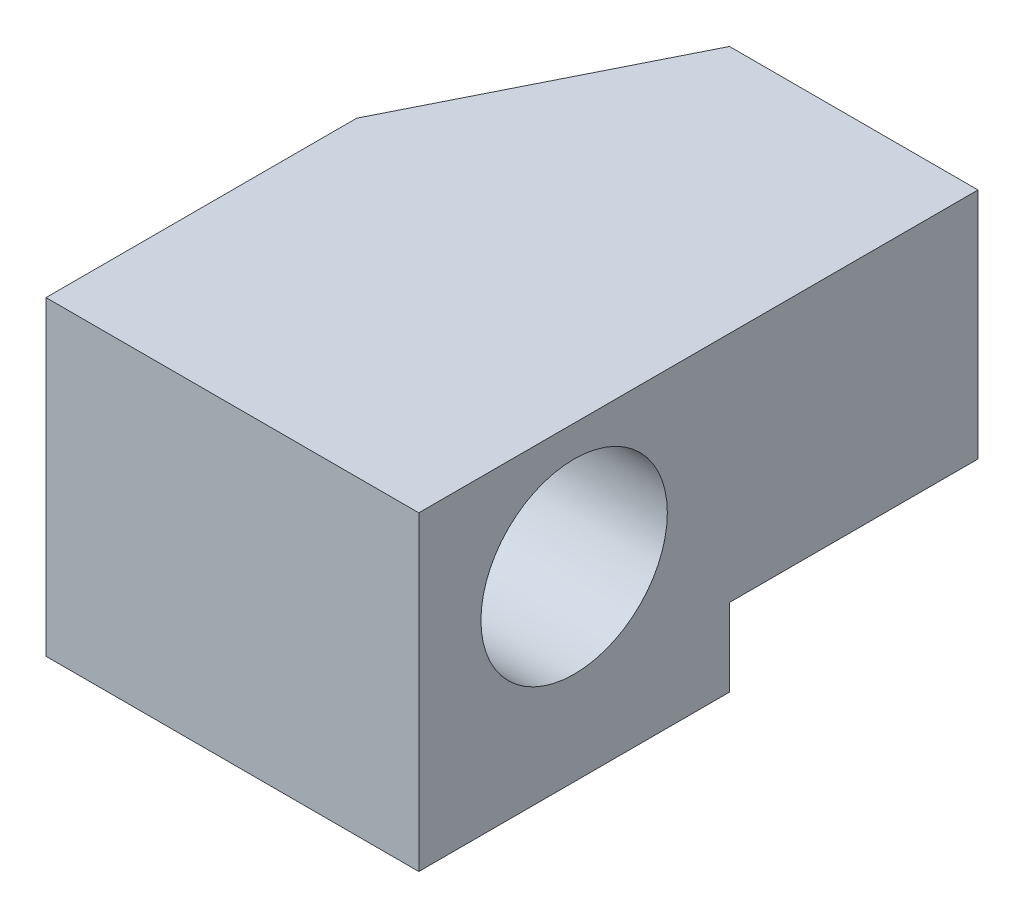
ISO-10303-21;
HEADER;
FILE_DESCRIPTION(('STEP AP214'),'2;1');
FILE_NAME('part.step','',(''),(''),'','','');
FILE_SCHEMA(('AUTOMOTIVE_DESIGN { 1 0 10303 214 1 1 1 1 }'));
ENDSEC;
DATA;
#1=APPLICATION_CONTEXT('core data for automotive mechanical design processes');
#2=APPLICATION_PROTOCOL_DEFINITION('international standard','automotive_design',2000,#1);
#3=PRODUCT_CONTEXT('',#1,'mechanical');
#4=PRODUCT('Part','Part','',(#3));
#5=PRODUCT_RELATED_PRODUCT_CATEGORY('part','',(#4));
#6=PRODUCT_DEFINITION_FORMATION('','',#4);
#7=PRODUCT_DEFINITION_CONTEXT('part definition',#1,'design');
#8=PRODUCT_DEFINITION('design','',#6,#7);
#9=PRODUCT_DEFINITION_SHAPE('','',#8);
#10=(LENGTH_UNIT() NAMED_UNIT(*) SI_UNIT(.MILLI.,.METRE.));
#11=(NAMED_UNIT(*) PLANE_ANGLE_UNIT() SI_UNIT($,.RADIAN.));
#12=(NAMED_UNIT(*) SI_UNIT($,.STERADIAN.) SOLID_ANGLE_UNIT());
#13=UNCERTAINTY_MEASURE_WITH_UNIT(LENGTH_MEASURE(1.E-05),#10,'distance_accuracy_value','');
#14=(GEOMETRIC_REPRESENTATION_CONTEXT(3) GLOBAL_UNCERTAINTY_ASSIGNED_CONTEXT((#13)) GLOBAL_UNIT_ASSIGNED_CONTEXT((#10,
#11,#12)) REPRESENTATION_CONTEXT('',''));
#15=CARTESIAN_POINT('',(0.,0.,0.));
#16=DIRECTION('',(0.,0.,1.));
#17=DIRECTION('',(1.,0.,0.));
#18=AXIS2_PLACEMENT_3D('',#15,#16,#17);
#19=CARTESIAN_POINT('',(-60.,50.,100.));
#20=DIRECTION('',(1.,0.,0.));
#21=DIRECTION('',(0.,1.,0.));
#22=AXIS2_PLACEMENT_3D('',#19,#20,#21);
#23=PLANE('',#22);
#24=CARTESIAN_POINT('',(-60.,9.99999999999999,50.));
#25=DIRECTION('',(-1.,0.,0.));
#26=DIRECTION('',(0.,-1.,0.));
#27=AXIS2_PLACEMENT_3D('',#24,#25,#26);
#28=CIRCLE('',#27,30.);
#29=CARTESIAN_POINT('',(-60.,-20.,50.));
#30=VERTEX_POINT('',#29);
#31=EDGE_CURVE('E193',#30,#30,#28,.T.);
#32=ORIENTED_EDGE('',*,*,#31,.F.);
#33=EDGE_LOOP('',(#32));
#34=FACE_BOUND('',#33,.T.);
#35=DIRECTION('',(0.,-1.,0.));
#36=VECTOR('',#35,1.);
#37=CARTESIAN_POINT('',(-60.,50.,0.));
#38=LINE('',#37,#36);
#39=CARTESIAN_POINT('',(-60.,50.,0.));
#40=VERTEX_POINT('',#39);
#41=CARTESIAN_POINT('',(-60.,-25.,0.));
#42=VERTEX_POINT('',#41);
#43=EDGE_CURVE('E130',#40,#42,#38,.T.);
#44=ORIENTED_EDGE('',*,*,#43,.T.);
#45=CARTESIAN_POINT('',(-60.,-50.,0.));
#46=VERTEX_POINT('',#45);
#47=EDGE_CURVE('E133',#42,#46,#38,.T.);
#48=ORIENTED_EDGE('',*,*,#47,.T.);
#49=DIRECTION('',(0.,0.,-1.));
#50=VECTOR('',#49,1.);
#51=CARTESIAN_POINT('',(-60.,-50.,100.));
#52=LINE('',#51,#50);
#53=CARTESIAN_POINT('',(-60.,-50.,100.));
#54=VERTEX_POINT('',#53);
#55=EDGE_CURVE('E11',#54,#46,#52,.T.);
#56=ORIENTED_EDGE('',*,*,#55,.F.);
#57=DIRECTION('',(0.,-1.,0.));
#58=VECTOR('',#57,1.);
#59=CARTESIAN_POINT('',(-60.,50.,100.));
#60=LINE('',#59,#58);
#61=CARTESIAN_POINT('',(-60.,50.,100.));
#62=VERTEX_POINT('',#61);
#63=EDGE_CURVE('E156',#62,#54,#60,.T.);
#64=ORIENTED_EDGE('',*,*,#63,.F.);
#65=DIRECTION('',(0.,0.,-1.));
#66=VECTOR('',#65,1.);
#67=CARTESIAN_POINT('',(-60.,50.,100.));
#68=LINE('',#67,#66);
#69=EDGE_CURVE('E140',#62,#40,#68,.T.);
#70=ORIENTED_EDGE('',*,*,#69,.T.);
#71=EDGE_LOOP('',(#44,#48,#56,#64,#70));
#72=FACE_BOUND('',#71,.T.);
#73=ADVANCED_FACE('F33',(#34,#72),#23,.F.);
#74=CARTESIAN_POINT('',(-60.,-50.,100.));
#75=DIRECTION('',(0.,1.,0.));
#76=DIRECTION('',(0.,0.,1.));
#77=AXIS2_PLACEMENT_3D('',#74,#75,#76);
#78=PLANE('',#77);
#79=DIRECTION('',(1.,0.,0.));
#80=VECTOR('',#79,1.);
#81=CARTESIAN_POINT('',(-60.,-50.,0.));
#82=LINE('',#81,#80);
#83=CARTESIAN_POINT('',(60.,-50.,0.));
#84=VERTEX_POINT('',#83);
#85=EDGE_CURVE('E73',#46,#84,#82,.T.);
#86=ORIENTED_EDGE('',*,*,#85,.T.);
#87=DIRECTION('',(0.,0.,-1.));
#88=VECTOR('',#87,1.);
#89=CARTESIAN_POINT('',(60.,-50.,100.));
#90=LINE('',#89,#88);
#91=CARTESIAN_POINT('',(60.,-50.,100.));
#92=VERTEX_POINT('',#91);
#93=EDGE_CURVE('E41',#92,#84,#90,.T.);
#94=ORIENTED_EDGE('',*,*,#93,.F.);
#95=DIRECTION('',(1.,0.,0.));
#96=VECTOR('',#95,1.);
#97=CARTESIAN_POINT('',(-60.,-50.,100.));
#98=LINE('',#97,#96);
#99=EDGE_CURVE('E78',#54,#92,#98,.T.);
#100=ORIENTED_EDGE('',*,*,#99,.F.);
#101=ORIENTED_EDGE('',*,*,#55,.T.);
#102=EDGE_LOOP('',(#86,#94,#100,#101));
#103=FACE_BOUND('',#102,.T.);
#104=ADVANCED_FACE('F163',(#103),#78,.F.);
#105=CARTESIAN_POINT('',(60.,50.,100.));
#106=DIRECTION('',(-1.,0.,0.));
#107=DIRECTION('',(0.,-1.,0.));
#108=AXIS2_PLACEMENT_3D('',#105,#106,#107);
#109=PLANE('',#108);
#110=CARTESIAN_POINT('',(60.,10.,50.));
#111=DIRECTION('',(-1.,0.,0.));
#112=DIRECTION('',(0.,-1.,0.));
#113=AXIS2_PLACEMENT_3D('',#110,#111,#112);
#114=CIRCLE('',#113,30.);
#115=CARTESIAN_POINT('',(60.,-20.,50.));
#116=VERTEX_POINT('',#115);
#117=EDGE_CURVE('E196',#116,#116,#114,.F.);
#118=ORIENTED_EDGE('',*,*,#117,.F.);
#119=EDGE_LOOP('',(#118));
#120=FACE_BOUND('',#119,.T.);
#121=DIRECTION('',(0.,1.,0.));
#122=VECTOR('',#121,1.);
#123=CARTESIAN_POINT('',(60.,50.,0.));
#124=LINE('',#123,#122);
#125=CARTESIAN_POINT('',(60.,-25.,0.));
#126=VERTEX_POINT('',#125);
#127=EDGE_CURVE('E116',#84,#126,#124,.T.);
#128=ORIENTED_EDGE('',*,*,#127,.T.);
#129=DIRECTION('',(0.,0.,-1.));
#130=VECTOR('',#129,1.);
#131=CARTESIAN_POINT('',(60.,-25.,-80.));
#132=LINE('',#131,#130);
#133=CARTESIAN_POINT('',(60.,-25.,-80.));
#134=VERTEX_POINT('',#133);
#135=EDGE_CURVE('E49',#126,#134,#132,.T.);
#136=ORIENTED_EDGE('',*,*,#135,.T.);
#137=DIRECTION('',(0.,1.,0.));
#138=VECTOR('',#137,1.);
#139=CARTESIAN_POINT('',(60.,-25.,-80.));
#140=LINE('',#139,#138);
#141=CARTESIAN_POINT('',(60.,50.,-80.));
#142=VERTEX_POINT('',#141);
#143=EDGE_CURVE('E99',#134,#142,#140,.T.);
#144=ORIENTED_EDGE('',*,*,#143,.T.);
#145=DIRECTION('',(0.,0.,-1.));
#146=VECTOR('',#145,1.);
#147=CARTESIAN_POINT('',(60.,50.,100.));
#148=LINE('',#147,#146);
#149=CARTESIAN_POINT('',(60.,50.,100.));
#150=VERTEX_POINT('',#149);
#151=EDGE_CURVE('E152',#150,#142,#148,.T.);
#152=ORIENTED_EDGE('',*,*,#151,.F.);
#153=DIRECTION('',(0.,1.,0.));
#154=VECTOR('',#153,1.);
#155=CARTESIAN_POINT('',(60.,50.,100.));
#156=LINE('',#155,#154);
#157=EDGE_CURVE('E155',#92,#150,#156,.T.);
#158=ORIENTED_EDGE('',*,*,#157,.F.);
#159=ORIENTED_EDGE('',*,*,#93,.T.);
#160=EDGE_LOOP('',(#128,#136,#144,#152,#158,#159));
#161=FACE_BOUND('',#160,.T.);
#162=ADVANCED_FACE('F114',(#120,#161),#109,.F.);
#163=CARTESIAN_POINT('',(-60.,50.,100.));
#164=DIRECTION('',(0.,-1.,0.));
#165=DIRECTION('',(0.,0.,-1.));
#166=AXIS2_PLACEMENT_3D('',#163,#164,#165);
#167=PLANE('',#166);
#168=ORIENTED_EDGE('',*,*,#151,.T.);
#169=DIRECTION('',(-1.,0.,0.));
#170=VECTOR('',#169,1.);
#171=CARTESIAN_POINT('',(-20.,50.,-80.));
#172=LINE('',#171,#170);
#173=CARTESIAN_POINT('',(-20.,50.,-80.));
#174=VERTEX_POINT('',#173);
#175=EDGE_CURVE('E104',#142,#174,#172,.T.);
#176=ORIENTED_EDGE('',*,*,#175,.T.);
#177=DIRECTION('',(-0.447213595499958,0.,0.894427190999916));
#178=VECTOR('',#177,1.);
#179=CARTESIAN_POINT('',(-60.,50.,0.));
#180=LINE('',#179,#178);
#181=EDGE_CURVE('E119',#174,#40,#180,.T.);
#182=ORIENTED_EDGE('',*,*,#181,.T.);
#183=ORIENTED_EDGE('',*,*,#69,.F.);
#184=DIRECTION('',(-1.,0.,0.));
#185=VECTOR('',#184,1.);
#186=CARTESIAN_POINT('',(-60.,50.,100.));
#187=LINE('',#186,#185);
#188=EDGE_CURVE('E58',#150,#62,#187,.T.);
#189=ORIENTED_EDGE('',*,*,#188,.F.);
#190=EDGE_LOOP('',(#168,#176,#182,#183,#189));
#191=FACE_BOUND('',#190,.T.);
#192=ADVANCED_FACE('F162',(#191),#167,.F.);
#193=CARTESIAN_POINT('',(-60.,-50.,100.));
#194=DIRECTION('',(0.,0.,1.));
#195=DIRECTION('',(1.,0.,0.));
#196=AXIS2_PLACEMENT_3D('',#193,#194,#195);
#197=PLANE('',#196);
#198=ORIENTED_EDGE('',*,*,#63,.T.);
#199=ORIENTED_EDGE('',*,*,#99,.T.);
#200=ORIENTED_EDGE('',*,*,#157,.T.);
#201=ORIENTED_EDGE('',*,*,#188,.T.);
#202=EDGE_LOOP('',(#198,#199,#200,#201));
#203=FACE_BOUND('',#202,.T.);
#204=ADVANCED_FACE('F160',(#203),#197,.T.);
#205=CARTESIAN_POINT('',(-60.,-50.,0.));
#206=DIRECTION('',(0.,0.,1.));
#207=DIRECTION('',(1.,0.,0.));
#208=AXIS2_PLACEMENT_3D('',#205,#206,#207);
#209=PLANE('',#208);
#210=ORIENTED_EDGE('',*,*,#47,.F.);
#211=DIRECTION('',(1.,0.,0.));
#212=VECTOR('',#211,1.);
#213=CARTESIAN_POINT('',(60.,-25.,0.));
#214=LINE('',#213,#212);
#215=EDGE_CURVE('E117',#42,#126,#214,.T.);
#216=ORIENTED_EDGE('',*,*,#215,.T.);
#217=ORIENTED_EDGE('',*,*,#127,.F.);
#218=ORIENTED_EDGE('',*,*,#85,.F.);
#219=EDGE_LOOP('',(#210,#216,#217,#218));
#220=FACE_BOUND('',#219,.T.);
#221=ADVANCED_FACE('F134',(#220),#209,.F.);
#222=CARTESIAN_POINT('',(-60.,-25.,0.));
#223=DIRECTION('',(-0.894427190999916,0.,-0.447213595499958));
#224=DIRECTION('',(-0.447213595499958,0.,0.894427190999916));
#225=AXIS2_PLACEMENT_3D('',#222,#223,#224);
#226=PLANE('',#225);
#227=ORIENTED_EDGE('',*,*,#181,.F.);
#228=DIRECTION('',(0.,1.,0.));
#229=VECTOR('',#228,1.);
#230=CARTESIAN_POINT('',(-20.,-25.,-80.));
#231=LINE('',#230,#229);
#232=CARTESIAN_POINT('',(-20.,-25.,-80.));
#233=VERTEX_POINT('',#232);
#234=EDGE_CURVE('E107',#233,#174,#231,.T.);
#235=ORIENTED_EDGE('',*,*,#234,.F.);
#236=DIRECTION('',(-0.447213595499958,0.,0.894427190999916));
#237=VECTOR('',#236,1.);
#238=CARTESIAN_POINT('',(-60.,-25.,0.));
#239=LINE('',#238,#237);
#240=EDGE_CURVE('E108',#233,#42,#239,.T.);
#241=ORIENTED_EDGE('',*,*,#240,.T.);
#242=ORIENTED_EDGE('',*,*,#43,.F.);
#243=EDGE_LOOP('',(#227,#235,#241,#242));
#244=FACE_BOUND('',#243,.T.);
#245=ADVANCED_FACE('F128',(#244),#226,.T.);
#246=CARTESIAN_POINT('',(-20.,-25.,-80.));
#247=DIRECTION('',(0.,0.,-1.));
#248=DIRECTION('',(-1.,0.,0.));
#249=AXIS2_PLACEMENT_3D('',#246,#247,#248);
#250=PLANE('',#249);
#251=ORIENTED_EDGE('',*,*,#175,.F.);
#252=ORIENTED_EDGE('',*,*,#143,.F.);
#253=DIRECTION('',(-1.,0.,0.));
#254=VECTOR('',#253,1.);
#255=CARTESIAN_POINT('',(-20.,-25.,-80.));
#256=LINE('',#255,#254);
#257=EDGE_CURVE('E101',#134,#233,#256,.T.);
#258=ORIENTED_EDGE('',*,*,#257,.T.);
#259=ORIENTED_EDGE('',*,*,#234,.T.);
#260=EDGE_LOOP('',(#251,#252,#258,#259));
#261=FACE_BOUND('',#260,.T.);
#262=ADVANCED_FACE('F100',(#261),#250,.T.);
#263=CARTESIAN_POINT('',(60.,-25.,0.));
#264=DIRECTION('',(0.,1.,0.));
#265=DIRECTION('',(0.,0.,1.));
#266=AXIS2_PLACEMENT_3D('',#263,#264,#265);
#267=PLANE('',#266);
#268=ORIENTED_EDGE('',*,*,#215,.F.);
#269=ORIENTED_EDGE('',*,*,#240,.F.);
#270=ORIENTED_EDGE('',*,*,#257,.F.);
#271=ORIENTED_EDGE('',*,*,#135,.F.);
#272=EDGE_LOOP('',(#268,#269,#270,#271));
#273=FACE_BOUND('',#272,.T.);
#274=ADVANCED_FACE('F110',(#273),#267,.F.);
#275=CARTESIAN_POINT('',(60.00105,10.,50.));
#276=DIRECTION('',(-1.,0.,0.));
#277=DIRECTION('',(0.,-1.,0.));
#278=AXIS2_PLACEMENT_3D('',#275,#276,#277);
#279=CYLINDRICAL_SURFACE('',#278,30.);
#280=ORIENTED_EDGE('',*,*,#31,.T.);
#281=EDGE_LOOP('',(#280));
#282=FACE_BOUND('',#281,.T.);
#283=ORIENTED_EDGE('',*,*,#117,.T.);
#284=EDGE_LOOP('',(#283));
#285=FACE_BOUND('',#284,.T.);
#286=ADVANCED_FACE('F185',(#282,#285),#279,.F.);
#287=CLOSED_SHELL('',(#73,#104,#162,#192,#204,#221,#245,#262,#274,#286));
#288=MANIFOLD_SOLID_BREP('B2',#287);
#289=ADVANCED_BREP_SHAPE_REPRESENTATION('',(#18,#288),#14);
#290=SHAPE_DEFINITION_REPRESENTATION(#9,#289);
ENDSEC;
END-ISO-10303-21;
